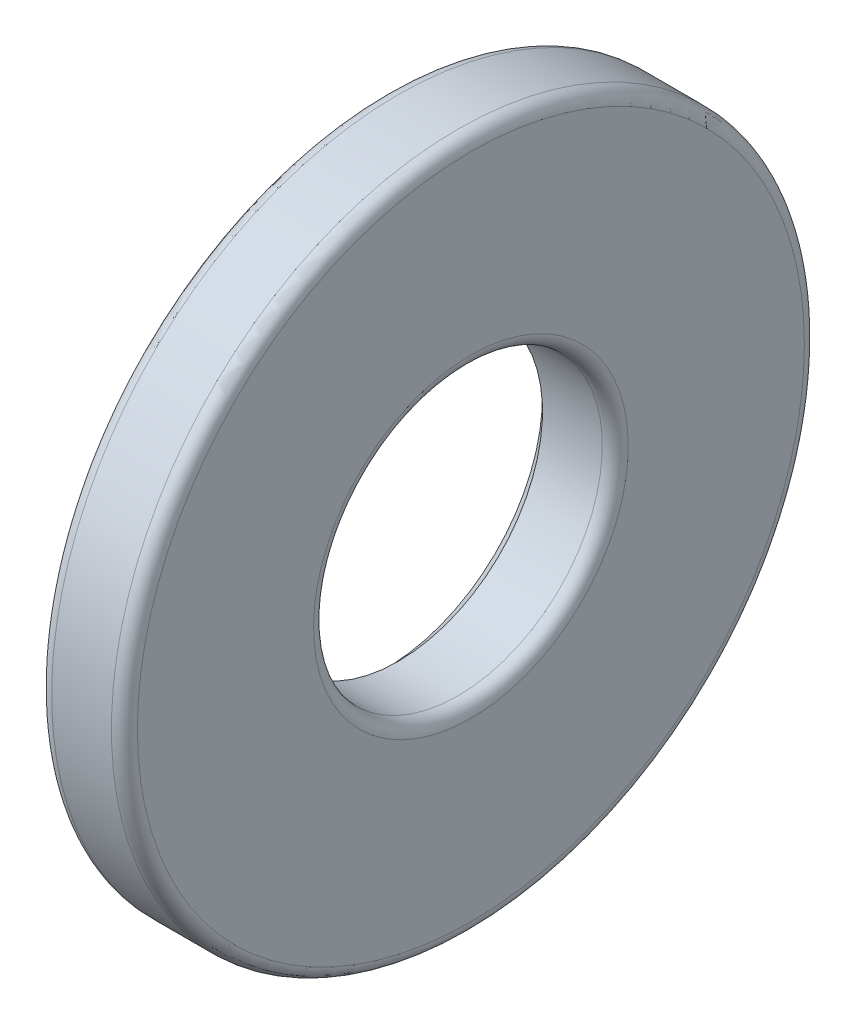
ISO-10303-21;
HEADER;
FILE_DESCRIPTION(('STEP AP214'),'2;1');
FILE_NAME('part.step','',(''),(''),'','','');
FILE_SCHEMA(('AUTOMOTIVE_DESIGN { 1 0 10303 214 1 1 1 1 }'));
ENDSEC;
DATA;
#1=APPLICATION_CONTEXT('core data for automotive mechanical design processes');
#2=APPLICATION_PROTOCOL_DEFINITION('international standard','automotive_design',2000,#1);
#3=PRODUCT_CONTEXT('',#1,'mechanical');
#4=PRODUCT('Part','Part','',(#3));
#5=PRODUCT_RELATED_PRODUCT_CATEGORY('part','',(#4));
#6=PRODUCT_DEFINITION_FORMATION('','',#4);
#7=PRODUCT_DEFINITION_CONTEXT('part definition',#1,'design');
#8=PRODUCT_DEFINITION('design','',#6,#7);
#9=PRODUCT_DEFINITION_SHAPE('','',#8);
#10=(LENGTH_UNIT() NAMED_UNIT(*) SI_UNIT(.MILLI.,.METRE.));
#11=(NAMED_UNIT(*) PLANE_ANGLE_UNIT() SI_UNIT($,.RADIAN.));
#12=(NAMED_UNIT(*) SI_UNIT($,.STERADIAN.) SOLID_ANGLE_UNIT());
#13=UNCERTAINTY_MEASURE_WITH_UNIT(LENGTH_MEASURE(1.E-05),#10,'distance_accuracy_value','');
#14=(GEOMETRIC_REPRESENTATION_CONTEXT(3) GLOBAL_UNCERTAINTY_ASSIGNED_CONTEXT((#13)) GLOBAL_UNIT_ASSIGNED_CONTEXT((#10,
#11,#12)) REPRESENTATION_CONTEXT('',''));
#15=CARTESIAN_POINT('',(0.,0.,0.));
#16=DIRECTION('',(0.,0.,1.));
#17=DIRECTION('',(1.,0.,0.));
#18=AXIS2_PLACEMENT_3D('',#15,#16,#17);
#19=CARTESIAN_POINT('',(6.03,5.97381320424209,0.));
#20=DIRECTION('',(-1.,0.,0.));
#21=DIRECTION('',(0.,-1.,0.));
#22=AXIS2_PLACEMENT_3D('',#19,#20,#21);
#23=PLANE('',#22);
#24=CARTESIAN_POINT('',(6.03,0.,0.));
#25=DIRECTION('',(-1.,0.,0.));
#26=DIRECTION('',(0.,1.,0.));
#27=AXIS2_PLACEMENT_3D('',#24,#25,#26);
#28=CIRCLE('',#27,5.45000000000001);
#29=CARTESIAN_POINT('',(6.03,5.45000000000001,0.));
#30=VERTEX_POINT('',#29);
#31=EDGE_CURVE('E81',#30,#30,#28,.T.);
#32=ORIENTED_EDGE('',*,*,#31,.F.);
#33=EDGE_LOOP('',(#32));
#34=FACE_BOUND('',#33,.T.);
#35=CARTESIAN_POINT('',(6.03,0.,0.));
#36=DIRECTION('',(-1.,0.,0.));
#37=DIRECTION('',(0.,1.,0.));
#38=AXIS2_PLACEMENT_3D('',#35,#36,#37);
#39=CIRCLE('',#38,6.49762640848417);
#40=CARTESIAN_POINT('',(6.03,6.49762640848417,0.));
#41=VERTEX_POINT('',#40);
#42=EDGE_CURVE('E10',#41,#41,#39,.T.);
#43=ORIENTED_EDGE('',*,*,#42,.T.);
#44=EDGE_LOOP('',(#43));
#45=FACE_BOUND('',#44,.T.);
#46=ADVANCED_FACE('F15',(#34,#45),#23,.T.);
#47=CARTESIAN_POINT('',(6.03,11.0261867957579,0.));
#48=DIRECTION('',(-1.,0.,0.));
#49=DIRECTION('',(0.,0.,1.));
#50=AXIS2_PLACEMENT_3D('',#47,#48,#49);
#51=PLANE('',#50);
#52=CARTESIAN_POINT('',(6.03,0.,0.));
#53=DIRECTION('',(-1.,0.,0.));
#54=DIRECTION('',(0.,1.,0.));
#55=AXIS2_PLACEMENT_3D('',#52,#53,#54);
#56=CIRCLE('',#55,10.5023735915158);
#57=CARTESIAN_POINT('',(6.03,10.5023735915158,0.));
#58=VERTEX_POINT('',#57);
#59=EDGE_CURVE('E82',#58,#58,#56,.T.);
#60=ORIENTED_EDGE('',*,*,#59,.F.);
#61=EDGE_LOOP('',(#60));
#62=FACE_BOUND('',#61,.T.);
#63=CARTESIAN_POINT('',(6.03,0.,0.));
#64=DIRECTION('',(-1.,0.,0.));
#65=DIRECTION('',(0.,1.,0.));
#66=AXIS2_PLACEMENT_3D('',#63,#64,#65);
#67=CIRCLE('',#66,11.55);
#68=CARTESIAN_POINT('',(6.03,11.55,0.));
#69=VERTEX_POINT('',#68);
#70=EDGE_CURVE('E23',#69,#69,#67,.T.);
#71=ORIENTED_EDGE('',*,*,#70,.T.);
#72=EDGE_LOOP('',(#71));
#73=FACE_BOUND('',#72,.T.);
#74=ADVANCED_FACE('F73',(#62,#73),#51,.T.);
#75=CARTESIAN_POINT('',(9.,8.5,0.));
#76=DIRECTION('',(1.,0.,0.));
#77=DIRECTION('',(0.,0.,-1.));
#78=AXIS2_PLACEMENT_3D('',#75,#76,#77);
#79=PLANE('',#78);
#80=CARTESIAN_POINT('',(9.,0.,0.));
#81=DIRECTION('',(-1.,0.,0.));
#82=DIRECTION('',(0.,1.,0.));
#83=AXIS2_PLACEMENT_3D('',#80,#81,#82);
#84=CIRCLE('',#83,5.45000000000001);
#85=CARTESIAN_POINT('',(9.,5.45000000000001,0.));
#86=VERTEX_POINT('',#85);
#87=EDGE_CURVE('E28',#86,#86,#84,.T.);
#88=ORIENTED_EDGE('',*,*,#87,.T.);
#89=EDGE_LOOP('',(#88));
#90=FACE_BOUND('',#89,.T.);
#91=CARTESIAN_POINT('',(9.,0.,0.));
#92=DIRECTION('',(-1.,0.,0.));
#93=DIRECTION('',(0.,1.,0.));
#94=AXIS2_PLACEMENT_3D('',#91,#92,#93);
#95=CIRCLE('',#94,11.55);
#96=CARTESIAN_POINT('',(9.,11.55,0.));
#97=VERTEX_POINT('',#96);
#98=EDGE_CURVE('E95',#97,#97,#95,.T.);
#99=ORIENTED_EDGE('',*,*,#98,.F.);
#100=EDGE_LOOP('',(#99));
#101=FACE_BOUND('',#100,.T.);
#102=ADVANCED_FACE('F46',(#90,#101),#79,.T.);
#103=CARTESIAN_POINT('',(7.515,0.,0.));
#104=DIRECTION('',(-1.,0.,0.));
#105=DIRECTION('',(0.,0.,1.));
#106=AXIS2_PLACEMENT_3D('',#103,#104,#105);
#107=CYLINDRICAL_SURFACE('',#106,5.);
#108=CARTESIAN_POINT('',(8.55,0.,0.));
#109=DIRECTION('',(-1.,0.,0.));
#110=DIRECTION('',(0.,1.,0.));
#111=AXIS2_PLACEMENT_3D('',#108,#109,#110);
#112=CIRCLE('',#111,5.);
#113=CARTESIAN_POINT('',(8.55,5.,0.));
#114=VERTEX_POINT('',#113);
#115=EDGE_CURVE('E34',#114,#114,#112,.T.);
#116=ORIENTED_EDGE('',*,*,#115,.F.);
#117=EDGE_LOOP('',(#116));
#118=FACE_BOUND('',#117,.T.);
#119=CARTESIAN_POINT('',(6.48,0.,0.));
#120=DIRECTION('',(-1.,0.,0.));
#121=DIRECTION('',(0.,1.,0.));
#122=AXIS2_PLACEMENT_3D('',#119,#120,#121);
#123=CIRCLE('',#122,5.);
#124=CARTESIAN_POINT('',(6.48,5.,0.));
#125=VERTEX_POINT('',#124);
#126=EDGE_CURVE('E83',#125,#125,#123,.T.);
#127=ORIENTED_EDGE('',*,*,#126,.T.);
#128=EDGE_LOOP('',(#127));
#129=FACE_BOUND('',#128,.T.);
#130=ADVANCED_FACE('F17',(#118,#129),#107,.F.);
#131=CARTESIAN_POINT('',(8.54999999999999,0.,0.));
#132=DIRECTION('',(-1.,0.,0.));
#133=DIRECTION('',(0.,0.,1.));
#134=AXIS2_PLACEMENT_3D('',#131,#132,#133);
#135=TOROIDAL_SURFACE('',#134,5.45000000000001,0.450000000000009);
#136=ORIENTED_EDGE('',*,*,#115,.T.);
#137=EDGE_LOOP('',(#136));
#138=FACE_BOUND('',#137,.T.);
#139=ORIENTED_EDGE('',*,*,#87,.F.);
#140=EDGE_LOOP('',(#139));
#141=FACE_BOUND('',#140,.T.);
#142=ADVANCED_FACE('F40',(#138,#141),#135,.T.);
#143=CARTESIAN_POINT('',(8.54999999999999,0.,0.));
#144=DIRECTION('',(-1.,0.,0.));
#145=DIRECTION('',(0.,0.,1.));
#146=AXIS2_PLACEMENT_3D('',#143,#144,#145);
#147=TOROIDAL_SURFACE('',#146,11.55,0.450000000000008);
#148=ORIENTED_EDGE('',*,*,#98,.T.);
#149=EDGE_LOOP('',(#148));
#150=FACE_BOUND('',#149,.T.);
#151=CARTESIAN_POINT('',(8.55,0.,0.));
#152=DIRECTION('',(-1.,0.,0.));
#153=DIRECTION('',(0.,1.,0.));
#154=AXIS2_PLACEMENT_3D('',#151,#152,#153);
#155=CIRCLE('',#154,12.);
#156=CARTESIAN_POINT('',(8.55,12.,0.));
#157=VERTEX_POINT('',#156);
#158=EDGE_CURVE('E92',#157,#157,#155,.T.);
#159=ORIENTED_EDGE('',*,*,#158,.F.);
#160=EDGE_LOOP('',(#159));
#161=FACE_BOUND('',#160,.T.);
#162=ADVANCED_FACE('F44',(#150,#161),#147,.T.);
#163=CARTESIAN_POINT('',(7.515,0.,0.));
#164=DIRECTION('',(-1.,0.,0.));
#165=DIRECTION('',(0.,0.,1.));
#166=AXIS2_PLACEMENT_3D('',#163,#164,#165);
#167=CYLINDRICAL_SURFACE('',#166,12.);
#168=CARTESIAN_POINT('',(6.48,0.,0.));
#169=DIRECTION('',(-1.,0.,0.));
#170=DIRECTION('',(0.,1.,0.));
#171=AXIS2_PLACEMENT_3D('',#168,#169,#170);
#172=CIRCLE('',#171,12.);
#173=CARTESIAN_POINT('',(6.48,12.,0.));
#174=VERTEX_POINT('',#173);
#175=EDGE_CURVE('E86',#174,#174,#172,.T.);
#176=ORIENTED_EDGE('',*,*,#175,.F.);
#177=EDGE_LOOP('',(#176));
#178=FACE_BOUND('',#177,.T.);
#179=ORIENTED_EDGE('',*,*,#158,.T.);
#180=EDGE_LOOP('',(#179));
#181=FACE_BOUND('',#180,.T.);
#182=ADVANCED_FACE('F50',(#178,#181),#167,.T.);
#183=CARTESIAN_POINT('',(6.48000000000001,0.,0.));
#184=DIRECTION('',(-1.,0.,0.));
#185=DIRECTION('',(0.,0.,1.));
#186=AXIS2_PLACEMENT_3D('',#183,#184,#185);
#187=TOROIDAL_SURFACE('',#186,11.55,0.450000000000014);
#188=ORIENTED_EDGE('',*,*,#175,.T.);
#189=EDGE_LOOP('',(#188));
#190=FACE_BOUND('',#189,.T.);
#191=ORIENTED_EDGE('',*,*,#70,.F.);
#192=EDGE_LOOP('',(#191));
#193=FACE_BOUND('',#192,.T.);
#194=ADVANCED_FACE('F54',(#190,#193),#187,.T.);
#195=CARTESIAN_POINT('',(4.5,0.,0.));
#196=DIRECTION('',(-1.,0.,0.));
#197=DIRECTION('',(0.,0.,1.));
#198=AXIS2_PLACEMENT_3D('',#195,#196,#197);
#199=TOROIDAL_SURFACE('',#198,8.5,2.52);
#200=ORIENTED_EDGE('',*,*,#59,.T.);
#201=EDGE_LOOP('',(#200));
#202=FACE_BOUND('',#201,.T.);
#203=ORIENTED_EDGE('',*,*,#42,.F.);
#204=EDGE_LOOP('',(#203));
#205=FACE_BOUND('',#204,.T.);
#206=ADVANCED_FACE('F58',(#202,#205),#199,.F.);
#207=DIRECTION('',(-0.707106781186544,0.707106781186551,0.));
#208=VECTOR('',#207,1.);
#209=CARTESIAN_POINT('',(-498988.519999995,499000.,-1.22215714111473E-10));
#210=LINE('',#209,#208);
#211=CARTESIAN_POINT('',(11.4799999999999,0.,0.));
#212=DIRECTION('',(-1.,0.,0.));
#213=AXIS1_PLACEMENT('',#211,#212);
#214=SURFACE_OF_REVOLUTION('',#210,#213);
#215=ORIENTED_EDGE('',*,*,#31,.T.);
#216=EDGE_LOOP('',(#215));
#217=FACE_BOUND('',#216,.T.);
#218=ORIENTED_EDGE('',*,*,#126,.F.);
#219=EDGE_LOOP('',(#218));
#220=FACE_BOUND('',#219,.T.);
#221=ADVANCED_FACE('F63',(#217,#220),#214,.F.);
#222=CLOSED_SHELL('',(#46,#74,#102,#130,#142,#162,#182,#194,#206,#221));
#223=MANIFOLD_SOLID_BREP('B1',#222);
#224=ADVANCED_BREP_SHAPE_REPRESENTATION('',(#18,#223),#14);
#225=SHAPE_DEFINITION_REPRESENTATION(#9,#224);
ENDSEC;
END-ISO-10303-21;
